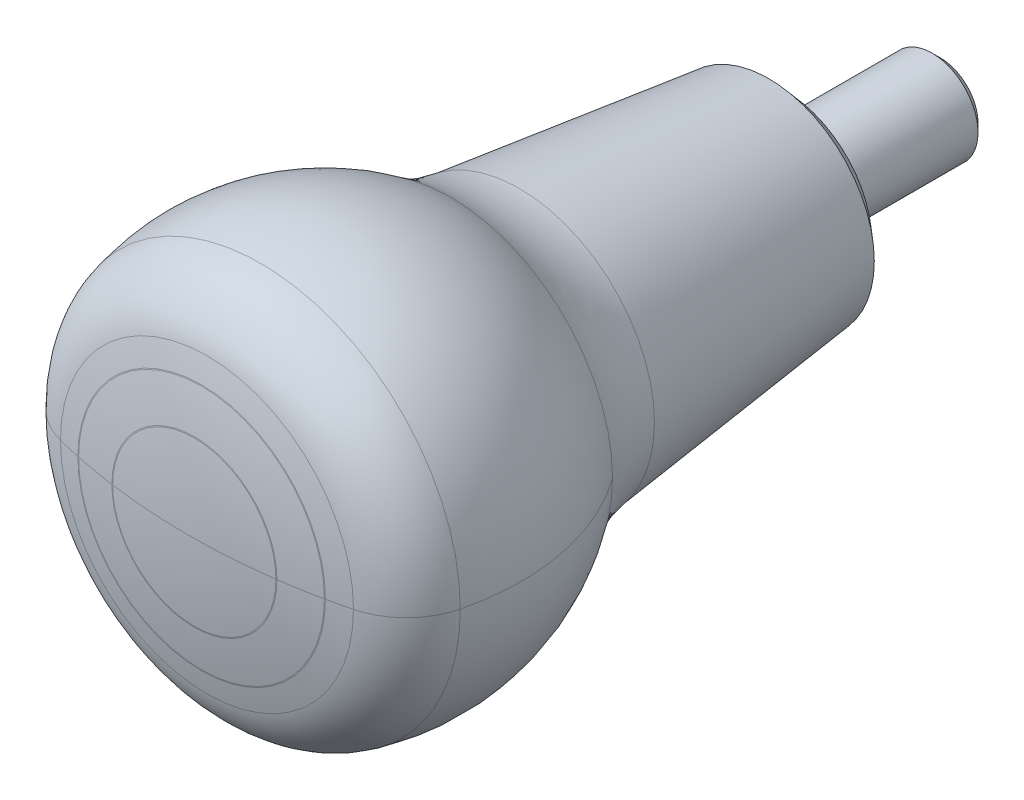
ISO-10303-21;
HEADER;
FILE_DESCRIPTION(('STEP AP214'),'2;1');
FILE_NAME('part.step','',(''),(''),'','','');
FILE_SCHEMA(('AUTOMOTIVE_DESIGN { 1 0 10303 214 1 1 1 1 }'));
ENDSEC;
DATA;
#1=APPLICATION_CONTEXT('core data for automotive mechanical design processes');
#2=APPLICATION_PROTOCOL_DEFINITION('international standard','automotive_design',2000,#1);
#3=PRODUCT_CONTEXT('',#1,'mechanical');
#4=PRODUCT('Part','Part','',(#3));
#5=PRODUCT_RELATED_PRODUCT_CATEGORY('part','',(#4));
#6=PRODUCT_DEFINITION_FORMATION('','',#4);
#7=PRODUCT_DEFINITION_CONTEXT('part definition',#1,'design');
#8=PRODUCT_DEFINITION('design','',#6,#7);
#9=PRODUCT_DEFINITION_SHAPE('','',#8);
#10=(LENGTH_UNIT() NAMED_UNIT(*) SI_UNIT(.MILLI.,.METRE.));
#11=(NAMED_UNIT(*) PLANE_ANGLE_UNIT() SI_UNIT($,.RADIAN.));
#12=(NAMED_UNIT(*) SI_UNIT($,.STERADIAN.) SOLID_ANGLE_UNIT());
#13=UNCERTAINTY_MEASURE_WITH_UNIT(LENGTH_MEASURE(1.E-05),#10,'distance_accuracy_value','');
#14=(GEOMETRIC_REPRESENTATION_CONTEXT(3) GLOBAL_UNCERTAINTY_ASSIGNED_CONTEXT((#13)) GLOBAL_UNIT_ASSIGNED_CONTEXT((#10,
#11,#12)) REPRESENTATION_CONTEXT('',''));
#15=CARTESIAN_POINT('',(0.,0.,0.));
#16=DIRECTION('',(0.,0.,1.));
#17=DIRECTION('',(1.,0.,0.));
#18=AXIS2_PLACEMENT_3D('',#15,#16,#17);
#19=CARTESIAN_POINT('',(0.,-2.04,-16.8));
#20=DIRECTION('',(0.,0.,-1.));
#21=DIRECTION('',(-1.,0.,0.));
#22=AXIS2_PLACEMENT_3D('',#19,#20,#21);
#23=PLANE('',#22);
#24=DIRECTION('',(0.866025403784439,0.5,0.));
#25=VECTOR('',#24,1.);
#26=CARTESIAN_POINT('',(-2.5,1.44337567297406,-16.8));
#27=LINE('',#26,#25);
#28=CARTESIAN_POINT('',(-2.5,1.44337567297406,-16.8));
#29=VERTEX_POINT('',#28);
#30=CARTESIAN_POINT('',(0.,2.88675134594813,-16.8));
#31=VERTEX_POINT('',#30);
#32=EDGE_CURVE('E32',#29,#31,#27,.T.);
#33=ORIENTED_EDGE('',*,*,#32,.F.);
#34=DIRECTION('',(0.,1.,0.));
#35=VECTOR('',#34,1.);
#36=CARTESIAN_POINT('',(-2.5,-1.44337567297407,-16.8));
#37=LINE('',#36,#35);
#38=CARTESIAN_POINT('',(-2.5,-1.44337567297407,-16.8));
#39=VERTEX_POINT('',#38);
#40=EDGE_CURVE('E171',#39,#29,#37,.T.);
#41=ORIENTED_EDGE('',*,*,#40,.F.);
#42=DIRECTION('',(-0.866025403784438,0.5,0.));
#43=VECTOR('',#42,1.);
#44=CARTESIAN_POINT('',(0.,-2.88675134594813,-16.8));
#45=LINE('',#44,#43);
#46=CARTESIAN_POINT('',(0.,-2.88675134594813,-16.8));
#47=VERTEX_POINT('',#46);
#48=EDGE_CURVE('E174',#47,#39,#45,.T.);
#49=ORIENTED_EDGE('',*,*,#48,.F.);
#50=DIRECTION('',(-0.866025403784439,-0.5,0.));
#51=VECTOR('',#50,1.);
#52=CARTESIAN_POINT('',(2.5,-1.44337567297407,-16.8));
#53=LINE('',#52,#51);
#54=CARTESIAN_POINT('',(2.5,-1.44337567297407,-16.8));
#55=VERTEX_POINT('',#54);
#56=EDGE_CURVE('E190',#55,#47,#53,.T.);
#57=ORIENTED_EDGE('',*,*,#56,.F.);
#58=DIRECTION('',(0.,-1.,0.));
#59=VECTOR('',#58,1.);
#60=CARTESIAN_POINT('',(2.5,1.44337567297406,-16.8));
#61=LINE('',#60,#59);
#62=CARTESIAN_POINT('',(2.5,1.44337567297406,-16.8));
#63=VERTEX_POINT('',#62);
#64=EDGE_CURVE('E187',#63,#55,#61,.T.);
#65=ORIENTED_EDGE('',*,*,#64,.F.);
#66=DIRECTION('',(0.866025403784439,-0.5,0.));
#67=VECTOR('',#66,1.);
#68=CARTESIAN_POINT('',(0.,2.88675134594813,-16.8));
#69=LINE('',#68,#67);
#70=EDGE_CURVE('E185',#31,#63,#69,.T.);
#71=ORIENTED_EDGE('',*,*,#70,.F.);
#72=EDGE_LOOP('',(#33,#41,#49,#57,#65,#71));
#73=FACE_BOUND('',#72,.T.);
#74=CARTESIAN_POINT('',(0.,0.,-16.8));
#75=DIRECTION('',(0.,0.,1.));
#76=DIRECTION('',(0.,1.,0.));
#77=AXIS2_PLACEMENT_3D('',#74,#75,#76);
#78=CIRCLE('',#77,4.08000000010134);
#79=CARTESIAN_POINT('',(0.,4.08000000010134,-16.8));
#80=VERTEX_POINT('',#79);
#81=EDGE_CURVE('E197',#80,#80,#78,.T.);
#82=ORIENTED_EDGE('',*,*,#81,.F.);
#83=EDGE_LOOP('',(#82));
#84=FACE_BOUND('',#83,.T.);
#85=ADVANCED_FACE('F14',(#73,#84),#23,.T.);
#86=CARTESIAN_POINT('',(0.,0.,-15.880000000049));
#87=DIRECTION('',(0.,0.,1.));
#88=DIRECTION('',(0.,1.,0.));
#89=AXIS2_PLACEMENT_3D('',#86,#87,#88);
#90=CONICAL_SURFACE('',#89,5.0000000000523,0.785398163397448);
#91=CARTESIAN_POINT('',(0.,0.,-15.88));
#92=DIRECTION('',(0.,0.,-1.));
#93=DIRECTION('',(0.,-1.,0.));
#94=AXIS2_PLACEMENT_3D('',#91,#92,#93);
#95=CIRCLE('',#94,5.);
#96=CARTESIAN_POINT('',(0.,-5.,-15.88));
#97=VERTEX_POINT('',#96);
#98=EDGE_CURVE('E447',#97,#97,#95,.F.);
#99=ORIENTED_EDGE('',*,*,#98,.F.);
#100=EDGE_LOOP('',(#99));
#101=FACE_BOUND('',#100,.T.);
#102=ORIENTED_EDGE('',*,*,#81,.T.);
#103=EDGE_LOOP('',(#102));
#104=FACE_BOUND('',#103,.T.);
#105=ADVANCED_FACE('F671',(#101,#104),#90,.T.);
#106=CARTESIAN_POINT('',(0.,0.,-9.2));
#107=DIRECTION('',(0.,0.,-1.));
#108=DIRECTION('',(0.,-1.,0.));
#109=AXIS2_PLACEMENT_3D('',#106,#107,#108);
#110=CYLINDRICAL_SURFACE('',#109,5.);
#111=CARTESIAN_POINT('',(0.,0.,-2.51999999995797));
#112=DIRECTION('',(0.,0.,-1.));
#113=DIRECTION('',(0.,-1.,0.));
#114=AXIS2_PLACEMENT_3D('',#111,#112,#113);
#115=CIRCLE('',#114,4.99999999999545);
#116=CARTESIAN_POINT('',(0.,-4.99999999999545,-2.51999999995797));
#117=VERTEX_POINT('',#116);
#118=EDGE_CURVE('E442',#117,#117,#115,.F.);
#119=ORIENTED_EDGE('',*,*,#118,.F.);
#120=EDGE_LOOP('',(#119));
#121=FACE_BOUND('',#120,.T.);
#122=ORIENTED_EDGE('',*,*,#98,.T.);
#123=EDGE_LOOP('',(#122));
#124=FACE_BOUND('',#123,.T.);
#125=ADVANCED_FACE('F679',(#121,#124),#110,.T.);
#126=CARTESIAN_POINT('',(0.,0.,-2.51999999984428));
#127=DIRECTION('',(0.,0.,-1.));
#128=DIRECTION('',(-1.,0.,0.));
#129=AXIS2_PLACEMENT_3D('',#126,#127,#128);
#130=CONICAL_SURFACE('',#129,4.99999999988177,0.785398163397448);
#131=CARTESIAN_POINT('',(0.,0.,-1.60000000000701));
#132=DIRECTION('',(0.,0.,-1.));
#133=DIRECTION('',(-1.,0.,0.));
#134=AXIS2_PLACEMENT_3D('',#131,#132,#133);
#135=CIRCLE('',#134,4.0800000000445);
#136=CARTESIAN_POINT('',(-4.0800000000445,0.,-1.60000000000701));
#137=VERTEX_POINT('',#136);
#138=EDGE_CURVE('E458',#137,#137,#135,.F.);
#139=ORIENTED_EDGE('',*,*,#138,.F.);
#140=EDGE_LOOP('',(#139));
#141=FACE_BOUND('',#140,.T.);
#142=ORIENTED_EDGE('',*,*,#118,.T.);
#143=EDGE_LOOP('',(#142));
#144=FACE_BOUND('',#143,.T.);
#145=ADVANCED_FACE('F434',(#141,#144),#130,.T.);
#146=CARTESIAN_POINT('',(0.,-4.04,-1.6));
#147=DIRECTION('',(0.,0.,1.));
#148=DIRECTION('',(1.,0.,0.));
#149=AXIS2_PLACEMENT_3D('',#146,#147,#148);
#150=PLANE('',#149);
#151=ORIENTED_EDGE('',*,*,#138,.T.);
#152=EDGE_LOOP('',(#151));
#153=FACE_BOUND('',#152,.T.);
#154=CARTESIAN_POINT('',(0.,0.,-1.6));
#155=DIRECTION('',(0.,0.,1.));
#156=DIRECTION('',(-1.,0.,0.));
#157=AXIS2_PLACEMENT_3D('',#154,#155,#156);
#158=CIRCLE('',#157,4.);
#159=CARTESIAN_POINT('',(0.,-4.,-1.6));
#160=VERTEX_POINT('',#159);
#161=CARTESIAN_POINT('',(-4.,0.,-1.6));
#162=VERTEX_POINT('',#161);
#163=EDGE_CURVE('E473',#160,#162,#158,.F.);
#164=ORIENTED_EDGE('',*,*,#163,.T.);
#165=CARTESIAN_POINT('',(0.,0.,-1.6));
#166=DIRECTION('',(0.,0.,1.));
#167=DIRECTION('',(1.,0.,0.));
#168=AXIS2_PLACEMENT_3D('',#165,#166,#167);
#169=CIRCLE('',#168,4.);
#170=CARTESIAN_POINT('',(4.,0.,-1.6));
#171=VERTEX_POINT('',#170);
#172=EDGE_CURVE('E418',#162,#171,#169,.F.);
#173=ORIENTED_EDGE('',*,*,#172,.T.);
#174=CARTESIAN_POINT('',(0.,0.,-1.6));
#175=DIRECTION('',(0.,0.,1.));
#176=DIRECTION('',(0.,-1.,0.));
#177=AXIS2_PLACEMENT_3D('',#174,#175,#176);
#178=CIRCLE('',#177,4.);
#179=EDGE_CURVE('E474',#171,#160,#178,.F.);
#180=ORIENTED_EDGE('',*,*,#179,.T.);
#181=EDGE_LOOP('',(#164,#173,#180));
#182=FACE_BOUND('',#181,.T.);
#183=ADVANCED_FACE('F394',(#153,#182),#150,.T.);
#184=CARTESIAN_POINT('',(0.,0.,-1.4));
#185=DIRECTION('',(0.,0.,1.));
#186=DIRECTION('',(1.,0.,0.));
#187=AXIS2_PLACEMENT_3D('',#184,#185,#186);
#188=TOROIDAL_SURFACE('',#187,4.,0.2);
#189=CARTESIAN_POINT('',(0.,0.,-1.4));
#190=DIRECTION('',(0.,0.,-1.));
#191=DIRECTION('',(0.,-1.,0.));
#192=AXIS2_PLACEMENT_3D('',#189,#190,#191);
#193=CIRCLE('',#192,3.8);
#194=CARTESIAN_POINT('',(0.,-3.8,-1.4));
#195=VERTEX_POINT('',#194);
#196=EDGE_CURVE('E386',#195,#195,#193,.F.);
#197=ORIENTED_EDGE('',*,*,#196,.F.);
#198=EDGE_LOOP('',(#197));
#199=FACE_BOUND('',#198,.T.);
#200=ORIENTED_EDGE('',*,*,#163,.F.);
#201=ORIENTED_EDGE('',*,*,#179,.F.);
#202=ORIENTED_EDGE('',*,*,#172,.F.);
#203=EDGE_LOOP('',(#200,#201,#202));
#204=FACE_BOUND('',#203,.T.);
#205=ADVANCED_FACE('F390',(#199,#204),#188,.F.);
#206=CARTESIAN_POINT('',(0.,0.,-0.925));
#207=DIRECTION('',(0.,0.,-1.));
#208=DIRECTION('',(0.,-1.,0.));
#209=AXIS2_PLACEMENT_3D('',#206,#207,#208);
#210=CYLINDRICAL_SURFACE('',#209,3.8);
#211=ORIENTED_EDGE('',*,*,#196,.T.);
#212=EDGE_LOOP('',(#211));
#213=FACE_BOUND('',#212,.T.);
#214=CARTESIAN_POINT('',(0.,0.,-0.45));
#215=DIRECTION('',(0.,0.,1.));
#216=DIRECTION('',(1.,0.,0.));
#217=AXIS2_PLACEMENT_3D('',#214,#215,#216);
#218=CIRCLE('',#217,3.8);
#219=CARTESIAN_POINT('',(3.8,0.,-0.45));
#220=VERTEX_POINT('',#219);
#221=EDGE_CURVE('E381',#220,#220,#218,.F.);
#222=ORIENTED_EDGE('',*,*,#221,.T.);
#223=EDGE_LOOP('',(#222));
#224=FACE_BOUND('',#223,.T.);
#225=ADVANCED_FACE('F361',(#213,#224),#210,.T.);
#226=CARTESIAN_POINT('',(0.,0.,-0.45));
#227=DIRECTION('',(0.,0.,1.));
#228=DIRECTION('',(1.,0.,0.));
#229=AXIS2_PLACEMENT_3D('',#226,#227,#228);
#230=TOROIDAL_SURFACE('',#229,4.25,0.45);
#231=CARTESIAN_POINT('',(0.,0.,0.));
#232=DIRECTION('',(0.,0.,-1.));
#233=DIRECTION('',(0.,-1.,0.));
#234=AXIS2_PLACEMENT_3D('',#231,#232,#233);
#235=CIRCLE('',#234,4.25);
#236=CARTESIAN_POINT('',(-4.25,0.,0.));
#237=VERTEX_POINT('',#236);
#238=CARTESIAN_POINT('',(0.,-4.25,0.));
#239=VERTEX_POINT('',#238);
#240=EDGE_CURVE('E333',#237,#239,#235,.F.);
#241=ORIENTED_EDGE('',*,*,#240,.F.);
#242=CARTESIAN_POINT('',(0.,0.,0.));
#243=DIRECTION('',(0.,0.,-1.));
#244=DIRECTION('',(-1.,0.,0.));
#245=AXIS2_PLACEMENT_3D('',#242,#243,#244);
#246=CIRCLE('',#245,4.25);
#247=CARTESIAN_POINT('',(4.25,0.,0.));
#248=VERTEX_POINT('',#247);
#249=EDGE_CURVE('E325',#248,#237,#246,.F.);
#250=ORIENTED_EDGE('',*,*,#249,.F.);
#251=CARTESIAN_POINT('',(0.,0.,0.));
#252=DIRECTION('',(0.,0.,-1.));
#253=DIRECTION('',(1.,0.,0.));
#254=AXIS2_PLACEMENT_3D('',#251,#252,#253);
#255=CIRCLE('',#254,4.25);
#256=EDGE_CURVE('E335',#239,#248,#255,.F.);
#257=ORIENTED_EDGE('',*,*,#256,.F.);
#258=EDGE_LOOP('',(#241,#250,#257));
#259=FACE_BOUND('',#258,.T.);
#260=ORIENTED_EDGE('',*,*,#221,.F.);
#261=EDGE_LOOP('',(#260));
#262=FACE_BOUND('',#261,.T.);
#263=ADVANCED_FACE('F299',(#259,#262),#230,.F.);
#264=CARTESIAN_POINT('',(0.,-5.125,0.));
#265=DIRECTION('',(0.,0.,-1.));
#266=DIRECTION('',(-1.,0.,0.));
#267=AXIS2_PLACEMENT_3D('',#264,#265,#266);
#268=PLANE('',#267);
#269=ORIENTED_EDGE('',*,*,#249,.T.);
#270=ORIENTED_EDGE('',*,*,#240,.T.);
#271=ORIENTED_EDGE('',*,*,#256,.T.);
#272=EDGE_LOOP('',(#269,#270,#271));
#273=FACE_BOUND('',#272,.T.);
#274=CARTESIAN_POINT('',(0.,0.,0.));
#275=DIRECTION('',(0.,0.,-1.));
#276=DIRECTION('',(0.,-1.,0.));
#277=AXIS2_PLACEMENT_3D('',#274,#275,#276);
#278=CIRCLE('',#277,6.);
#279=CARTESIAN_POINT('',(0.,-6.,0.));
#280=VERTEX_POINT('',#279);
#281=EDGE_CURVE('E455',#280,#280,#278,.F.);
#282=ORIENTED_EDGE('',*,*,#281,.F.);
#283=EDGE_LOOP('',(#282));
#284=FACE_BOUND('',#283,.T.);
#285=ADVANCED_FACE('F294',(#273,#284),#268,.T.);
#286=CARTESIAN_POINT('',(0.,0.,0.0999999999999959));
#287=DIRECTION('',(0.,0.,-1.));
#288=DIRECTION('',(0.,-1.,0.));
#289=AXIS2_PLACEMENT_3D('',#286,#287,#288);
#290=CYLINDRICAL_SURFACE('',#289,6.);
#291=CARTESIAN_POINT('',(0.,0.,0.2));
#292=DIRECTION('',(0.,0.,-1.));
#293=DIRECTION('',(0.,-1.,0.));
#294=AXIS2_PLACEMENT_3D('',#291,#292,#293);
#295=CIRCLE('',#294,6.);
#296=CARTESIAN_POINT('',(0.,-6.,0.2));
#297=VERTEX_POINT('',#296);
#298=EDGE_CURVE('E452',#297,#297,#295,.F.);
#299=ORIENTED_EDGE('',*,*,#298,.F.);
#300=EDGE_LOOP('',(#299));
#301=FACE_BOUND('',#300,.T.);
#302=ORIENTED_EDGE('',*,*,#281,.T.);
#303=EDGE_LOOP('',(#302));
#304=FACE_BOUND('',#303,.T.);
#305=ADVANCED_FACE('F290',(#301,#304),#290,.T.);
#306=CARTESIAN_POINT('',(0.,-7.75,0.2));
#307=DIRECTION('',(0.,0.,-1.));
#308=DIRECTION('',(-1.,0.,0.));
#309=AXIS2_PLACEMENT_3D('',#306,#307,#308);
#310=PLANE('',#309);
#311=ORIENTED_EDGE('',*,*,#298,.T.);
#312=EDGE_LOOP('',(#311));
#313=FACE_BOUND('',#312,.T.);
#314=CARTESIAN_POINT('',(0.,0.,0.200000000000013));
#315=DIRECTION('',(0.,0.,1.));
#316=DIRECTION('',(1.,0.,0.));
#317=AXIS2_PLACEMENT_3D('',#314,#315,#316);
#318=CIRCLE('',#317,9.5);
#319=CARTESIAN_POINT('',(9.5,0.,0.200000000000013));
#320=VERTEX_POINT('',#319);
#321=EDGE_CURVE('E276',#320,#320,#318,.T.);
#322=ORIENTED_EDGE('',*,*,#321,.F.);
#323=EDGE_LOOP('',(#322));
#324=FACE_BOUND('',#323,.T.);
#325=ADVANCED_FACE('F286',(#313,#324),#310,.T.);
#326=CARTESIAN_POINT('',(-5.14556505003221E-05,0.,0.199172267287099));
#327=DIRECTION('',(0.,1.,0.));
#328=DIRECTION('',(1.,0.,0.));
#329=AXIS2_PLACEMENT_3D('',#326,#327,#328);
#330=CIRCLE('',#329,65.0008277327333);
#331=TRIMMED_CURVE('',#330,(PARAMETER_VALUE(-1.57079553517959)),
(PARAMETER_VALUE(1.57079553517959)),.T.,.PARAMETER.);
#332=CARTESIAN_POINT('',(0.,0.,0.199172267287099));
#333=DIRECTION('',(0.,0.,1.));
#334=AXIS1_PLACEMENT('',#332,#333);
#335=SURFACE_OF_REVOLUTION('',#331,#334);
#336=CARTESIAN_POINT('',(5.14556505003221E-05,0.,0.199172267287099));
#337=DIRECTION('',(0.,-1.,0.));
#338=DIRECTION('',(-1.,0.,0.));
#339=AXIS2_PLACEMENT_3D('',#336,#337,#338);
#340=CIRCLE('',#339,65.0008277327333);
#341=CARTESIAN_POINT('',(-13.5,0.,63.7826309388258));
#342=VERTEX_POINT('',#341);
#343=CARTESIAN_POINT('',(-15.9766122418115,0.,63.2059482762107));
#344=VERTEX_POINT('',#343);
#345=EDGE_CURVE('E265',#342,#344,#340,.T.);
#346=ORIENTED_EDGE('',*,*,#345,.F.);
#347=CARTESIAN_POINT('',(0.,0.,63.7826309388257));
#348=DIRECTION('',(0.,0.,1.));
#349=DIRECTION('',(1.,0.,0.));
#350=AXIS2_PLACEMENT_3D('',#347,#348,#349);
#351=CIRCLE('',#350,13.5);
#352=CARTESIAN_POINT('',(13.5,0.,63.7826309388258));
#353=VERTEX_POINT('',#352);
#354=EDGE_CURVE('E279',#342,#353,#351,.F.);
#355=ORIENTED_EDGE('',*,*,#354,.T.);
#356=CARTESIAN_POINT('',(-5.14556505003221E-05,0.,0.199172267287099));
#357=DIRECTION('',(0.,1.,0.));
#358=DIRECTION('',(1.,0.,0.));
#359=AXIS2_PLACEMENT_3D('',#356,#357,#358);
#360=CIRCLE('',#359,65.0008277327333);
#361=CARTESIAN_POINT('',(15.9766122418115,0.,63.2059482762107));
#362=VERTEX_POINT('',#361);
#363=EDGE_CURVE('E273',#362,#353,#360,.F.);
#364=ORIENTED_EDGE('',*,*,#363,.F.);
#365=CARTESIAN_POINT('',(0.,0.,63.2059482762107));
#366=DIRECTION('',(0.,0.,1.));
#367=DIRECTION('',(1.,0.,0.));
#368=AXIS2_PLACEMENT_3D('',#365,#366,#367);
#369=CIRCLE('',#368,15.9766122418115);
#370=EDGE_CURVE('E262',#344,#362,#369,.F.);
#371=ORIENTED_EDGE('',*,*,#370,.F.);
#372=EDGE_LOOP('',(#346,#355,#364,#371));
#373=FACE_BOUND('',#372,.T.);
#374=ADVANCED_FACE('F282',(#373),#335,.F.);
#375=CARTESIAN_POINT('',(0.,0.,1.92843217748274));
#376=DIRECTION('',(0.,0.,1.));
#377=DIRECTION('',(1.,0.,0.));
#378=AXIS2_PLACEMENT_3D('',#375,#376,#377);
#379=CONICAL_SURFACE('',#378,11.5,0.858106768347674);
#380=CARTESIAN_POINT('',(0.,0.,1.9284321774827));
#381=DIRECTION('',(0.,0.,1.));
#382=DIRECTION('',(0.,-1.,0.));
#383=AXIS2_PLACEMENT_3D('',#380,#381,#382);
#384=CIRCLE('',#383,11.5);
#385=CARTESIAN_POINT('',(0.,-11.5,1.9284321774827));
#386=VERTEX_POINT('',#385);
#387=EDGE_CURVE('E264',#386,#386,#384,.T.);
#388=ORIENTED_EDGE('',*,*,#387,.F.);
#389=EDGE_LOOP('',(#388));
#390=FACE_BOUND('',#389,.T.);
#391=ORIENTED_EDGE('',*,*,#321,.T.);
#392=EDGE_LOOP('',(#391));
#393=FACE_BOUND('',#392,.T.);
#394=ADVANCED_FACE('F285',(#390,#393),#379,.T.);
#395=CARTESIAN_POINT('',(-5.14556505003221E-05,0.,0.199172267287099));
#396=DIRECTION('',(0.,1.,0.));
#397=DIRECTION('',(1.,0.,0.));
#398=AXIS2_PLACEMENT_3D('',#395,#396,#397);
#399=CIRCLE('',#398,65.0008277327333);
#400=TRIMMED_CURVE('',#399,(PARAMETER_VALUE(-1.57079553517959)),
(PARAMETER_VALUE(1.57079553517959)),.T.,.PARAMETER.);
#401=CARTESIAN_POINT('',(0.,0.,0.199172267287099));
#402=DIRECTION('',(0.,0.,1.));
#403=AXIS1_PLACEMENT('',#401,#402);
#404=SURFACE_OF_REVOLUTION('',#400,#403);
#405=CARTESIAN_POINT('',(0.,0.,63.2059482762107));
#406=DIRECTION('',(0.,0.,1.));
#407=DIRECTION('',(1.,0.,0.));
#408=AXIS2_PLACEMENT_3D('',#405,#406,#407);
#409=CIRCLE('',#408,15.9766122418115);
#410=CARTESIAN_POINT('',(0.,-15.9766122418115,63.2059482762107));
#411=VERTEX_POINT('',#410);
#412=EDGE_CURVE('E772',#411,#344,#409,.F.);
#413=ORIENTED_EDGE('',*,*,#412,.F.);
#414=CARTESIAN_POINT('',(0.,0.,63.2059482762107));
#415=DIRECTION('',(0.,0.,1.));
#416=DIRECTION('',(1.,0.,0.));
#417=AXIS2_PLACEMENT_3D('',#414,#415,#416);
#418=CIRCLE('',#417,15.9766122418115);
#419=EDGE_CURVE('E768',#362,#411,#418,.F.);
#420=ORIENTED_EDGE('',*,*,#419,.F.);
#421=ORIENTED_EDGE('',*,*,#363,.T.);
#422=CARTESIAN_POINT('',(0.,0.,63.7826309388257));
#423=DIRECTION('',(0.,0.,1.));
#424=DIRECTION('',(1.,0.,0.));
#425=AXIS2_PLACEMENT_3D('',#422,#423,#424);
#426=CIRCLE('',#425,13.5);
#427=EDGE_CURVE('E270',#353,#342,#426,.F.);
#428=ORIENTED_EDGE('',*,*,#427,.T.);
#429=ORIENTED_EDGE('',*,*,#345,.T.);
#430=EDGE_LOOP('',(#413,#420,#421,#428,#429));
#431=FACE_BOUND('',#430,.T.);
#432=ADVANCED_FACE('F253',(#431),#404,.F.);
#433=CARTESIAN_POINT('',(0.,0.,55.451386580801));
#434=DIRECTION('',(0.,0.,1.));
#435=DIRECTION('',(1.,0.,0.));
#436=AXIS2_PLACEMENT_3D('',#433,#434,#435);
#437=TOROIDAL_SURFACE('',#436,14.0102198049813,7.99999539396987);
#438=CARTESIAN_POINT('',(-14.0102198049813,0.,55.451386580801));
#439=DIRECTION('',(0.,-1.,0.));
#440=DIRECTION('',(-1.,0.,0.));
#441=AXIS2_PLACEMENT_3D('',#438,#439,#440);
#442=CIRCLE('',#441,7.99999539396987);
#443=CARTESIAN_POINT('',(-21.7797205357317,0.,57.3578977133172));
#444=VERTEX_POINT('',#443);
#445=EDGE_CURVE('E237',#344,#444,#442,.T.);
#446=ORIENTED_EDGE('',*,*,#445,.F.);
#447=ORIENTED_EDGE('',*,*,#370,.T.);
#448=CARTESIAN_POINT('',(14.0102198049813,0.,55.451386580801));
#449=DIRECTION('',(0.,1.,0.));
#450=DIRECTION('',(1.,0.,0.));
#451=AXIS2_PLACEMENT_3D('',#448,#449,#450);
#452=CIRCLE('',#451,7.99999539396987);
#453=CARTESIAN_POINT('',(21.7797205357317,0.,57.3578977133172));
#454=VERTEX_POINT('',#453);
#455=EDGE_CURVE('E260',#454,#362,#452,.F.);
#456=ORIENTED_EDGE('',*,*,#455,.F.);
#457=CARTESIAN_POINT('',(0.,0.,57.3578977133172));
#458=DIRECTION('',(0.,0.,1.));
#459=DIRECTION('',(1.,0.,0.));
#460=AXIS2_PLACEMENT_3D('',#457,#458,#459);
#461=CIRCLE('',#460,21.7797205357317);
#462=EDGE_CURVE('E231',#444,#454,#461,.F.);
#463=ORIENTED_EDGE('',*,*,#462,.F.);
#464=EDGE_LOOP('',(#446,#447,#456,#463));
#465=FACE_BOUND('',#464,.T.);
#466=ADVANCED_FACE('F248',(#465),#437,.T.);
#467=CARTESIAN_POINT('',(0.,0.,29.1578448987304));
#468=DIRECTION('',(0.,0.,1.));
#469=DIRECTION('',(1.,0.,0.));
#470=AXIS2_PLACEMENT_3D('',#467,#468,#469);
#471=CONICAL_SURFACE('',#470,14.7528672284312,0.118898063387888);
#472=CARTESIAN_POINT('',(0.,0.,29.1578448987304));
#473=DIRECTION('',(0.,0.,1.));
#474=DIRECTION('',(1.,0.,0.));
#475=AXIS2_PLACEMENT_3D('',#472,#473,#474);
#476=CIRCLE('',#475,14.7528672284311);
#477=CARTESIAN_POINT('',(14.7528672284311,0.,29.1578448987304));
#478=VERTEX_POINT('',#477);
#479=EDGE_CURVE('E229',#478,#478,#476,.F.);
#480=ORIENTED_EDGE('',*,*,#479,.T.);
#481=EDGE_LOOP('',(#480));
#482=FACE_BOUND('',#481,.T.);
#483=ORIENTED_EDGE('',*,*,#387,.T.);
#484=EDGE_LOOP('',(#483));
#485=FACE_BOUND('',#484,.T.);
#486=ADVANCED_FACE('F244',(#482,#485),#471,.T.);
#487=CARTESIAN_POINT('',(0.,0.,55.451386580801));
#488=DIRECTION('',(0.,0.,1.));
#489=DIRECTION('',(1.,0.,0.));
#490=AXIS2_PLACEMENT_3D('',#487,#488,#489);
#491=TOROIDAL_SURFACE('',#490,14.0102198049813,7.99999539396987);
#492=CARTESIAN_POINT('',(0.,0.,57.3578977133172));
#493=DIRECTION('',(0.,0.,1.));
#494=DIRECTION('',(1.,0.,0.));
#495=AXIS2_PLACEMENT_3D('',#492,#493,#494);
#496=CIRCLE('',#495,21.7797205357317);
#497=CARTESIAN_POINT('',(0.,-21.7797205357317,57.3578977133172));
#498=VERTEX_POINT('',#497);
#499=EDGE_CURVE('E784',#498,#444,#496,.F.);
#500=ORIENTED_EDGE('',*,*,#499,.F.);
#501=CARTESIAN_POINT('',(0.,0.,57.3578977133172));
#502=DIRECTION('',(0.,0.,1.));
#503=DIRECTION('',(1.,0.,0.));
#504=AXIS2_PLACEMENT_3D('',#501,#502,#503);
#505=CIRCLE('',#504,21.7797205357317);
#506=EDGE_CURVE('E781',#454,#498,#505,.F.);
#507=ORIENTED_EDGE('',*,*,#506,.F.);
#508=ORIENTED_EDGE('',*,*,#455,.T.);
#509=ORIENTED_EDGE('',*,*,#419,.T.);
#510=ORIENTED_EDGE('',*,*,#412,.T.);
#511=ORIENTED_EDGE('',*,*,#445,.T.);
#512=EDGE_LOOP('',(#500,#507,#508,#509,#510,#511));
#513=FACE_BOUND('',#512,.T.);
#514=ADVANCED_FACE('F241',(#513),#491,.T.);
#515=CARTESIAN_POINT('',(-2.50001842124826,0.,51.4001080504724));
#516=DIRECTION('',(0.,1.,0.));
#517=DIRECTION('',(1.,0.,0.));
#518=AXIS2_PLACEMENT_3D('',#515,#516,#517);
#519=CIRCLE('',#518,25.0000196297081);
#520=TRIMMED_CURVE('',#519,(PARAMETER_VALUE(-1.47062824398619)),
(PARAMETER_VALUE(1.47062824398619)),.T.,.PARAMETER.);
#521=CARTESIAN_POINT('',(0.,0.,51.4001080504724));
#522=DIRECTION('',(0.,0.,1.));
#523=AXIS1_PLACEMENT('',#521,#522);
#524=SURFACE_OF_REVOLUTION('',#520,#523);
#525=CARTESIAN_POINT('',(2.50001842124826,0.,51.4001080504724));
#526=DIRECTION('',(0.,-1.,0.));
#527=DIRECTION('',(-1.,0.,0.));
#528=AXIS2_PLACEMENT_3D('',#525,#526,#527);
#529=CIRCLE('',#528,25.0000196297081);
#530=CARTESIAN_POINT('',(-17.7072603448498,0.,36.680499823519));
#531=VERTEX_POINT('',#530);
#532=EDGE_CURVE('E24',#444,#531,#529,.T.);
#533=ORIENTED_EDGE('',*,*,#532,.F.);
#534=ORIENTED_EDGE('',*,*,#462,.T.);
#535=CARTESIAN_POINT('',(-2.50001842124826,0.,51.4001080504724));
#536=DIRECTION('',(0.,1.,0.));
#537=DIRECTION('',(1.,0.,0.));
#538=AXIS2_PLACEMENT_3D('',#535,#536,#537);
#539=CIRCLE('',#538,25.0000196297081);
#540=CARTESIAN_POINT('',(17.7072603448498,0.,36.680499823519));
#541=VERTEX_POINT('',#540);
#542=EDGE_CURVE('E227',#541,#454,#539,.F.);
#543=ORIENTED_EDGE('',*,*,#542,.F.);
#544=CARTESIAN_POINT('',(0.,0.,36.680499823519));
#545=DIRECTION('',(0.,0.,1.));
#546=DIRECTION('',(1.,0.,0.));
#547=AXIS2_PLACEMENT_3D('',#544,#545,#546);
#548=CIRCLE('',#547,17.7072603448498);
#549=EDGE_CURVE('E41',#541,#531,#548,.T.);
#550=ORIENTED_EDGE('',*,*,#549,.T.);
#551=EDGE_LOOP('',(#533,#534,#543,#550));
#552=FACE_BOUND('',#551,.T.);
#553=ADVANCED_FACE('F220',(#552),#524,.F.);
#554=CARTESIAN_POINT('',(0.,0.,27.2599549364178));
#555=DIRECTION('',(0.,0.,1.));
#556=DIRECTION('',(1.,0.,0.));
#557=AXIS2_PLACEMENT_3D('',#554,#555,#556);
#558=TOROIDAL_SURFACE('',#557,30.6399064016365,16.0000000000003);
#559=CARTESIAN_POINT('',(0.,0.,36.680499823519));
#560=DIRECTION('',(0.,0.,1.));
#561=DIRECTION('',(1.,0.,0.));
#562=AXIS2_PLACEMENT_3D('',#559,#560,#561);
#563=CIRCLE('',#562,17.7072603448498);
#564=EDGE_CURVE('E9',#531,#541,#563,.T.);
#565=ORIENTED_EDGE('',*,*,#564,.F.);
#566=ORIENTED_EDGE('',*,*,#549,.F.);
#567=EDGE_LOOP('',(#565,#566));
#568=FACE_BOUND('',#567,.T.);
#569=ORIENTED_EDGE('',*,*,#479,.F.);
#570=EDGE_LOOP('',(#569));
#571=FACE_BOUND('',#570,.T.);
#572=ADVANCED_FACE('F213',(#568,#571),#558,.F.);
#573=CARTESIAN_POINT('',(-2.50001842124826,0.,51.4001080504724));
#574=DIRECTION('',(0.,1.,0.));
#575=DIRECTION('',(1.,0.,0.));
#576=AXIS2_PLACEMENT_3D('',#573,#574,#575);
#577=CIRCLE('',#576,25.0000196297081);
#578=TRIMMED_CURVE('',#577,(PARAMETER_VALUE(-1.47062824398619)),
(PARAMETER_VALUE(1.47062824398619)),.T.,.PARAMETER.);
#579=CARTESIAN_POINT('',(0.,0.,51.4001080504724));
#580=DIRECTION('',(0.,0.,1.));
#581=AXIS1_PLACEMENT('',#579,#580);
#582=SURFACE_OF_REVOLUTION('',#578,#581);
#583=ORIENTED_EDGE('',*,*,#564,.T.);
#584=ORIENTED_EDGE('',*,*,#542,.T.);
#585=ORIENTED_EDGE('',*,*,#506,.T.);
#586=ORIENTED_EDGE('',*,*,#499,.T.);
#587=ORIENTED_EDGE('',*,*,#532,.T.);
#588=EDGE_LOOP('',(#583,#584,#585,#586,#587));
#589=FACE_BOUND('',#588,.T.);
#590=ADVANCED_FACE('F208',(#589),#582,.F.);
#591=CARTESIAN_POINT('',(0.,0.,0.199172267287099));
#592=DIRECTION('',(0.,0.,-1.));
#593=DIRECTION('',(0.,1.,0.));
#594=AXIS2_PLACEMENT_3D('',#591,#592,#593);
#595=DEGENERATE_TOROIDAL_SURFACE('',#594,5.14556505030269E-05,65.0008277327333,.F.);
#596=CARTESIAN_POINT('',(0.,0.,63.8037808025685));
#597=DIRECTION('',(0.,0.,1.));
#598=DIRECTION('',(1.,0.,0.));
#599=AXIS2_PLACEMENT_3D('',#596,#597,#598);
#600=CIRCLE('',#599,13.4);
#601=CARTESIAN_POINT('',(13.4,0.,63.8037808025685));
#602=VERTEX_POINT('',#601);
#603=CARTESIAN_POINT('',(-13.4,0.,63.8037808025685));
#604=VERTEX_POINT('',#603);
#605=EDGE_CURVE('E340',#602,#604,#600,.F.);
#606=ORIENTED_EDGE('',*,*,#605,.T.);
#607=CARTESIAN_POINT('',(0.,0.,63.8037808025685));
#608=DIRECTION('',(0.,0.,1.));
#609=DIRECTION('',(1.,0.,0.));
#610=AXIS2_PLACEMENT_3D('',#607,#608,#609);
#611=CIRCLE('',#610,13.4);
#612=EDGE_CURVE('E338',#604,#602,#611,.F.);
#613=ORIENTED_EDGE('',*,*,#612,.T.);
#614=EDGE_LOOP('',(#606,#613));
#615=FACE_BOUND('',#614,.T.);
#616=ORIENTED_EDGE('',*,*,#354,.F.);
#617=ORIENTED_EDGE('',*,*,#427,.F.);
#618=EDGE_LOOP('',(#616,#617));
#619=FACE_BOUND('',#618,.T.);
#620=ADVANCED_FACE('F212',(#615,#619),#595,.F.);
#621=CARTESIAN_POINT('',(-5.14556505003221E-05,0.,0.199172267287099));
#622=DIRECTION('',(0.,1.,0.));
#623=DIRECTION('',(1.,0.,0.));
#624=AXIS2_PLACEMENT_3D('',#621,#622,#623);
#625=CIRCLE('',#624,65.0008277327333);
#626=TRIMMED_CURVE('',#625,(PARAMETER_VALUE(-1.57079553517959)),
(PARAMETER_VALUE(1.57079553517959)),.T.,.PARAMETER.);
#627=CARTESIAN_POINT('',(0.,0.,0.199172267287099));
#628=DIRECTION('',(0.,0.,1.));
#629=AXIS1_PLACEMENT('',#627,#628);
#630=SURFACE_OF_REVOLUTION('',#626,#629);
#631=CARTESIAN_POINT('',(5.14556505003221E-05,0.,0.199172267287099));
#632=DIRECTION('',(0.,-1.,0.));
#633=DIRECTION('',(-1.,0.,0.));
#634=AXIS2_PLACEMENT_3D('',#631,#632,#633);
#635=CIRCLE('',#634,65.0008277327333);
#636=CARTESIAN_POINT('',(-9.,0.,64.5739086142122));
#637=VERTEX_POINT('',#636);
#638=EDGE_CURVE('E342',#637,#604,#635,.T.);
#639=ORIENTED_EDGE('',*,*,#638,.T.);
#640=ORIENTED_EDGE('',*,*,#605,.F.);
#641=CARTESIAN_POINT('',(-5.14556505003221E-05,0.,0.199172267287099));
#642=DIRECTION('',(0.,1.,0.));
#643=DIRECTION('',(1.,0.,0.));
#644=AXIS2_PLACEMENT_3D('',#641,#642,#643);
#645=CIRCLE('',#644,65.0008277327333);
#646=CARTESIAN_POINT('',(9.,0.,64.5739086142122));
#647=VERTEX_POINT('',#646);
#648=EDGE_CURVE('E347',#602,#647,#645,.F.);
#649=ORIENTED_EDGE('',*,*,#648,.T.);
#650=CARTESIAN_POINT('',(0.,0.,64.5739086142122));
#651=DIRECTION('',(0.,0.,1.));
#652=DIRECTION('',(1.,0.,0.));
#653=AXIS2_PLACEMENT_3D('',#650,#651,#652);
#654=CIRCLE('',#653,9.);
#655=EDGE_CURVE('E106',#647,#637,#654,.F.);
#656=ORIENTED_EDGE('',*,*,#655,.T.);
#657=EDGE_LOOP('',(#639,#640,#649,#656));
#658=FACE_BOUND('',#657,.T.);
#659=ADVANCED_FACE('F301',(#658),#630,.F.);
#660=CARTESIAN_POINT('',(-5.14556505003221E-05,0.,0.199172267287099));
#661=DIRECTION('',(0.,1.,0.));
#662=DIRECTION('',(1.,0.,0.));
#663=AXIS2_PLACEMENT_3D('',#660,#661,#662);
#664=CIRCLE('',#663,65.0008277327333);
#665=TRIMMED_CURVE('',#664,(PARAMETER_VALUE(-1.57079553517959)),
(PARAMETER_VALUE(1.57079553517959)),.T.,.PARAMETER.);
#666=CARTESIAN_POINT('',(0.,0.,0.199172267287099));
#667=DIRECTION('',(0.,0.,1.));
#668=AXIS1_PLACEMENT('',#666,#667);
#669=SURFACE_OF_REVOLUTION('',#665,#668);
#670=ORIENTED_EDGE('',*,*,#638,.F.);
#671=CARTESIAN_POINT('',(0.,0.,64.5739086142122));
#672=DIRECTION('',(0.,0.,1.));
#673=DIRECTION('',(1.,0.,0.));
#674=AXIS2_PLACEMENT_3D('',#671,#672,#673);
#675=CIRCLE('',#674,9.);
#676=EDGE_CURVE('E109',#637,#647,#675,.F.);
#677=ORIENTED_EDGE('',*,*,#676,.T.);
#678=ORIENTED_EDGE('',*,*,#648,.F.);
#679=ORIENTED_EDGE('',*,*,#612,.F.);
#680=EDGE_LOOP('',(#670,#677,#678,#679));
#681=FACE_BOUND('',#680,.T.);
#682=ADVANCED_FACE('F362',(#681),#669,.F.);
#683=CARTESIAN_POINT('',(0.,0.,64.587810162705));
#684=DIRECTION('',(0.,0.,1.));
#685=DIRECTION('',(1.,0.,0.));
#686=AXIS2_PLACEMENT_3D('',#683,#684,#685);
#687=CIRCLE('',#686,8.9);
#688=CARTESIAN_POINT('',(8.9,0.,64.587810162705));
#689=VERTEX_POINT('',#688);
#690=CARTESIAN_POINT('',(-8.9,0.,64.587810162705));
#691=VERTEX_POINT('',#690);
#692=EDGE_CURVE('E410',#689,#691,#687,.F.);
#693=ORIENTED_EDGE('',*,*,#692,.T.);
#694=CARTESIAN_POINT('',(0.,0.,64.5878101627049));
#695=DIRECTION('',(0.,0.,1.));
#696=DIRECTION('',(1.,0.,0.));
#697=AXIS2_PLACEMENT_3D('',#694,#695,#696);
#698=CIRCLE('',#697,8.9);
#699=EDGE_CURVE('E419',#691,#689,#698,.F.);
#700=ORIENTED_EDGE('',*,*,#699,.T.);
#701=EDGE_LOOP('',(#693,#700));
#702=FACE_BOUND('',#701,.T.);
#703=ORIENTED_EDGE('',*,*,#676,.F.);
#704=ORIENTED_EDGE('',*,*,#655,.F.);
#705=EDGE_LOOP('',(#703,#704));
#706=FACE_BOUND('',#705,.T.);
#707=ADVANCED_FACE('F215',(#702,#706),#595,.F.);
#708=CARTESIAN_POINT('',(-5.14556505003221E-05,0.,0.199172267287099));
#709=DIRECTION('',(0.,1.,0.));
#710=DIRECTION('',(1.,0.,0.));
#711=AXIS2_PLACEMENT_3D('',#708,#709,#710);
#712=CIRCLE('',#711,65.0008277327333);
#713=TRIMMED_CURVE('',#712,(PARAMETER_VALUE(-1.57079553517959)),
(PARAMETER_VALUE(1.57079553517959)),.T.,.PARAMETER.);
#714=CARTESIAN_POINT('',(0.,0.,0.199172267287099));
#715=DIRECTION('',(0.,0.,1.));
#716=AXIS1_PLACEMENT('',#714,#715);
#717=SURFACE_OF_REVOLUTION('',#713,#716);
#718=ORIENTED_EDGE('',*,*,#692,.F.);
#719=CARTESIAN_POINT('',(-5.14556505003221E-05,0.,0.199172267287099));
#720=DIRECTION('',(0.,1.,0.));
#721=DIRECTION('',(1.,0.,0.));
#722=AXIS2_PLACEMENT_3D('',#719,#720,#721);
#723=CIRCLE('',#722,65.0008277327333);
#724=CARTESIAN_POINT('',(0.,0.,65.2));
#725=VERTEX_POINT('',#724);
#726=EDGE_CURVE('E424',#689,#725,#723,.F.);
#727=ORIENTED_EDGE('',*,*,#726,.T.);
#728=CARTESIAN_POINT('',(5.14556505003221E-05,0.,0.199172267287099));
#729=DIRECTION('',(0.,-1.,0.));
#730=DIRECTION('',(-1.,0.,0.));
#731=AXIS2_PLACEMENT_3D('',#728,#729,#730);
#732=CIRCLE('',#731,65.0008277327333);
#733=EDGE_CURVE('E99',#725,#691,#732,.T.);
#734=ORIENTED_EDGE('',*,*,#733,.T.);
#735=EDGE_LOOP('',(#718,#727,#734));
#736=FACE_BOUND('',#735,.T.);
#737=ADVANCED_FACE('F426',(#736),#717,.F.);
#738=CARTESIAN_POINT('',(-5.14556505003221E-05,0.,0.199172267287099));
#739=DIRECTION('',(0.,1.,0.));
#740=DIRECTION('',(1.,0.,0.));
#741=AXIS2_PLACEMENT_3D('',#738,#739,#740);
#742=CIRCLE('',#741,65.0008277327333);
#743=TRIMMED_CURVE('',#742,(PARAMETER_VALUE(-1.57079553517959)),
(PARAMETER_VALUE(1.57079553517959)),.T.,.PARAMETER.);
#744=CARTESIAN_POINT('',(0.,0.,0.199172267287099));
#745=DIRECTION('',(0.,0.,1.));
#746=AXIS1_PLACEMENT('',#744,#745);
#747=SURFACE_OF_REVOLUTION('',#743,#746);
#748=ORIENTED_EDGE('',*,*,#699,.F.);
#749=ORIENTED_EDGE('',*,*,#733,.F.);
#750=ORIENTED_EDGE('',*,*,#726,.F.);
#751=EDGE_LOOP('',(#748,#749,#750));
#752=FACE_BOUND('',#751,.T.);
#753=ADVANCED_FACE('F429',(#752),#747,.F.);
#754=CARTESIAN_POINT('',(-2.5,1.44337567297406,-12.55));
#755=DIRECTION('',(-0.5,0.866025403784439,0.));
#756=DIRECTION('',(-0.866025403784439,-0.5,0.));
#757=AXIS2_PLACEMENT_3D('',#754,#755,#756);
#758=PLANE('',#757);
#759=ORIENTED_EDGE('',*,*,#32,.T.);
#760=DIRECTION('',(0.,0.,-1.));
#761=VECTOR('',#760,1.);
#762=CARTESIAN_POINT('',(0.,2.88675134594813,-12.55));
#763=LINE('',#762,#761);
#764=CARTESIAN_POINT('',(0.,2.88675134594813,-12.55));
#765=VERTEX_POINT('',#764);
#766=EDGE_CURVE('E148',#765,#31,#763,.T.);
#767=ORIENTED_EDGE('',*,*,#766,.F.);
#768=DIRECTION('',(0.866025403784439,0.5,0.));
#769=VECTOR('',#768,1.);
#770=CARTESIAN_POINT('',(-2.5,1.44337567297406,-12.55));
#771=LINE('',#770,#769);
#772=CARTESIAN_POINT('',(-2.5,1.44337567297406,-12.55));
#773=VERTEX_POINT('',#772);
#774=EDGE_CURVE('E152',#773,#765,#771,.T.);
#775=ORIENTED_EDGE('',*,*,#774,.F.);
#776=DIRECTION('',(0.,0.,-1.));
#777=VECTOR('',#776,1.);
#778=CARTESIAN_POINT('',(-2.5,1.44337567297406,-12.55));
#779=LINE('',#778,#777);
#780=EDGE_CURVE('E195',#773,#29,#779,.T.);
#781=ORIENTED_EDGE('',*,*,#780,.T.);
#782=EDGE_LOOP('',(#759,#767,#775,#781));
#783=FACE_BOUND('',#782,.T.);
#784=ADVANCED_FACE('F150',(#783),#758,.F.);
#785=CARTESIAN_POINT('',(-2.5,-1.44337567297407,-12.55));
#786=DIRECTION('',(-1.,0.,0.));
#787=DIRECTION('',(0.,0.,1.));
#788=AXIS2_PLACEMENT_3D('',#785,#786,#787);
#789=PLANE('',#788);
#790=ORIENTED_EDGE('',*,*,#40,.T.);
#791=ORIENTED_EDGE('',*,*,#780,.F.);
#792=DIRECTION('',(0.,1.,0.));
#793=VECTOR('',#792,1.);
#794=CARTESIAN_POINT('',(-2.5,-1.44337567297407,-12.55));
#795=LINE('',#794,#793);
#796=CARTESIAN_POINT('',(-2.5,-1.44337567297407,-12.55));
#797=VERTEX_POINT('',#796);
#798=EDGE_CURVE('E158',#797,#773,#795,.T.);
#799=ORIENTED_EDGE('',*,*,#798,.F.);
#800=DIRECTION('',(0.,0.,-1.));
#801=VECTOR('',#800,1.);
#802=CARTESIAN_POINT('',(-2.5,-1.44337567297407,-12.55));
#803=LINE('',#802,#801);
#804=EDGE_CURVE('E198',#797,#39,#803,.T.);
#805=ORIENTED_EDGE('',*,*,#804,.T.);
#806=EDGE_LOOP('',(#790,#791,#799,#805));
#807=FACE_BOUND('',#806,.T.);
#808=ADVANCED_FACE('F607',(#807),#789,.F.);
#809=CARTESIAN_POINT('',(0.,-2.88675134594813,-12.55));
#810=DIRECTION('',(-0.5,-0.866025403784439,0.));
#811=DIRECTION('',(0.866025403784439,-0.5,0.));
#812=AXIS2_PLACEMENT_3D('',#809,#810,#811);
#813=PLANE('',#812);
#814=ORIENTED_EDGE('',*,*,#48,.T.);
#815=ORIENTED_EDGE('',*,*,#804,.F.);
#816=DIRECTION('',(-0.866025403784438,0.5,0.));
#817=VECTOR('',#816,1.);
#818=CARTESIAN_POINT('',(0.,-2.88675134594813,-12.55));
#819=LINE('',#818,#817);
#820=CARTESIAN_POINT('',(0.,-2.88675134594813,-12.55));
#821=VERTEX_POINT('',#820);
#822=EDGE_CURVE('E181',#821,#797,#819,.T.);
#823=ORIENTED_EDGE('',*,*,#822,.F.);
#824=DIRECTION('',(0.,0.,-1.));
#825=VECTOR('',#824,1.);
#826=CARTESIAN_POINT('',(0.,-2.88675134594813,-12.55));
#827=LINE('',#826,#825);
#828=EDGE_CURVE('E200',#821,#47,#827,.T.);
#829=ORIENTED_EDGE('',*,*,#828,.T.);
#830=EDGE_LOOP('',(#814,#815,#823,#829));
#831=FACE_BOUND('',#830,.T.);
#832=ADVANCED_FACE('F614',(#831),#813,.F.);
#833=CARTESIAN_POINT('',(2.5,-1.44337567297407,-12.55));
#834=DIRECTION('',(0.5,-0.866025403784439,0.));
#835=DIRECTION('',(0.866025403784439,0.5,0.));
#836=AXIS2_PLACEMENT_3D('',#833,#834,#835);
#837=PLANE('',#836);
#838=ORIENTED_EDGE('',*,*,#56,.T.);
#839=ORIENTED_EDGE('',*,*,#828,.F.);
#840=DIRECTION('',(-0.866025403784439,-0.5,0.));
#841=VECTOR('',#840,1.);
#842=CARTESIAN_POINT('',(2.5,-1.44337567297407,-12.55));
#843=LINE('',#842,#841);
#844=CARTESIAN_POINT('',(2.5,-1.44337567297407,-12.55));
#845=VERTEX_POINT('',#844);
#846=EDGE_CURVE('E178',#845,#821,#843,.T.);
#847=ORIENTED_EDGE('',*,*,#846,.F.);
#848=DIRECTION('',(0.,0.,-1.));
#849=VECTOR('',#848,1.);
#850=CARTESIAN_POINT('',(2.5,-1.44337567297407,-12.55));
#851=LINE('',#850,#849);
#852=EDGE_CURVE('E202',#845,#55,#851,.T.);
#853=ORIENTED_EDGE('',*,*,#852,.T.);
#854=EDGE_LOOP('',(#838,#839,#847,#853));
#855=FACE_BOUND('',#854,.T.);
#856=ADVANCED_FACE('F623',(#855),#837,.F.);
#857=CARTESIAN_POINT('',(2.5,1.44337567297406,-12.55));
#858=DIRECTION('',(1.,0.,0.));
#859=DIRECTION('',(0.,1.,0.));
#860=AXIS2_PLACEMENT_3D('',#857,#858,#859);
#861=PLANE('',#860);
#862=ORIENTED_EDGE('',*,*,#64,.T.);
#863=ORIENTED_EDGE('',*,*,#852,.F.);
#864=DIRECTION('',(0.,-1.,0.));
#865=VECTOR('',#864,1.);
#866=CARTESIAN_POINT('',(2.5,1.44337567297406,-12.55));
#867=LINE('',#866,#865);
#868=CARTESIAN_POINT('',(2.5,1.44337567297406,-12.55));
#869=VERTEX_POINT('',#868);
#870=EDGE_CURVE('E166',#869,#845,#867,.T.);
#871=ORIENTED_EDGE('',*,*,#870,.F.);
#872=DIRECTION('',(0.,0.,-1.));
#873=VECTOR('',#872,1.);
#874=CARTESIAN_POINT('',(2.5,1.44337567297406,-12.55));
#875=LINE('',#874,#873);
#876=EDGE_CURVE('E157',#869,#63,#875,.T.);
#877=ORIENTED_EDGE('',*,*,#876,.T.);
#878=EDGE_LOOP('',(#862,#863,#871,#877));
#879=FACE_BOUND('',#878,.T.);
#880=ADVANCED_FACE('F632',(#879),#861,.F.);
#881=CARTESIAN_POINT('',(0.,2.88675134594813,-12.55));
#882=DIRECTION('',(0.5,0.866025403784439,0.));
#883=DIRECTION('',(-0.866025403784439,0.5,0.));
#884=AXIS2_PLACEMENT_3D('',#881,#882,#883);
#885=PLANE('',#884);
#886=ORIENTED_EDGE('',*,*,#70,.T.);
#887=ORIENTED_EDGE('',*,*,#876,.F.);
#888=DIRECTION('',(0.866025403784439,-0.5,0.));
#889=VECTOR('',#888,1.);
#890=CARTESIAN_POINT('',(0.,2.88675134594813,-12.55));
#891=LINE('',#890,#889);
#892=EDGE_CURVE('E161',#765,#869,#891,.T.);
#893=ORIENTED_EDGE('',*,*,#892,.F.);
#894=ORIENTED_EDGE('',*,*,#766,.T.);
#895=EDGE_LOOP('',(#886,#887,#893,#894));
#896=FACE_BOUND('',#895,.T.);
#897=ADVANCED_FACE('F162',(#896),#885,.F.);
#898=CARTESIAN_POINT('',(0.,2.88675134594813,-12.55));
#899=DIRECTION('',(0.,0.,-1.));
#900=DIRECTION('',(-1.,0.,0.));
#901=AXIS2_PLACEMENT_3D('',#898,#899,#900);
#902=PLANE('',#901);
#903=ORIENTED_EDGE('',*,*,#774,.T.);
#904=ORIENTED_EDGE('',*,*,#892,.T.);
#905=ORIENTED_EDGE('',*,*,#870,.T.);
#906=ORIENTED_EDGE('',*,*,#846,.T.);
#907=ORIENTED_EDGE('',*,*,#822,.T.);
#908=ORIENTED_EDGE('',*,*,#798,.T.);
#909=EDGE_LOOP('',(#903,#904,#905,#906,#907,#908));
#910=FACE_BOUND('',#909,.T.);
#911=ADVANCED_FACE('F168',(#910),#902,.T.);
#912=CLOSED_SHELL('',(#85,#105,#125,#145,#183,#205,#225,#263,#285,#305,#325,#374,#394,#432,#466,
#486,#514,#553,#572,#590,#620,#659,#682,#707,#737,#753,#784,#808,#832,#856,#880,#897,#911));
#913=MANIFOLD_SOLID_BREP('B1',#912);
#914=ADVANCED_BREP_SHAPE_REPRESENTATION('',(#18,#913),#14);
#915=SHAPE_DEFINITION_REPRESENTATION(#9,#914);
ENDSEC;
END-ISO-10303-21;
